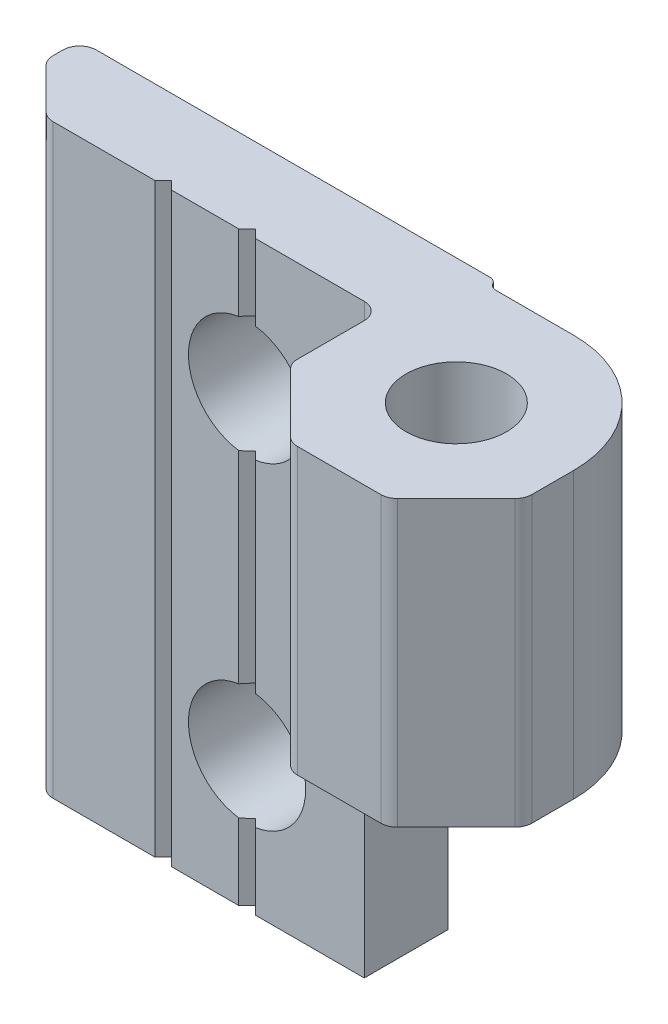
from build123d import *

# Parameters (mm, degrees)
SKETCH_1_R                = 3
EXTRUDE_1_DEPTH           = 35
SKETCH_2_W                = 25.824194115
SKETCH_2_H                = 25.192330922
CUT_EXTRUDE_1_DEPTH       = 35
HOLE_WIZARD_7_0_7_1_D     = 7
HOLE_WIZARD_7_0_7_1_DEPTH = 30
HOLE_WIZARD_7_0_7_1_TIP   = 2.103012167


with BuildPart() as part:
    # Sketch 1 → Extrude 1 (new body)
    with BuildSketch(Plane(origin=(0, 0, 0), x_dir=(1, 0, 0), z_dir=(0, 1, 0))):
        with BuildLine():
            Line((-30, 5.914213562), (-30, 6.5))
            ThreePointArc((-30, 6.5), (-29.707106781, 7.207106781), (-29, 7.5))
            Line((-29, 7.5), (-5.5, 7.5))
            ThreePointArc((-5.5, 7.5), (-5.25, 7.433012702), (-5.066987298, 7.25))
            ThreePointArc((-5.066987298, 7.25), (-4.883974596, 7.066987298), (-4.633974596, 7))
            Line((-4.633974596, 7), (0, 7))
            ThreePointArc((0, 7), (4.949747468, 4.949747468), (7, 0))
            Line((7, 0), (7, -2.485281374))
            ThreePointArc((7, -2.485281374), (6.923879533, -2.867964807), (6.707106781, -3.192388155))
            Line((6.707106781, -3.192388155), (3.192388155, -6.707106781))
            ThreePointArc((3.192388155, -6.707106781), (2.867964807, -6.923879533), (2.485281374, -7))
            Line((2.485281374, -7), (-2.485281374, -7))
            ThreePointArc((-2.485281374, -7), (-2.867964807, -6.923879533), (-3.192388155, -6.707106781))
            Line((-3.192388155, -6.707106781), (-6.707106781, -3.192388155))
            ThreePointArc((-6.707106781, -3.192388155), (-6.923879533, -2.867964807), (-7, -2.485281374))
            Line((-7, -2.485281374), (-7, 1.5))
            ThreePointArc((-7, 1.5), (-7.292893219, 2.207106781), (-8, 2.5))
            Line((-8, 2.5), (-14.5, 2.5))
            Line((-14.5, 2.5), (-15, 3))
            Line((-15, 3), (-15.5, 2.5))
            Line((-15.5, 2.5), (-19.5, 2.5))
            Line((-19.5, 2.5), (-20, 3))
            Line((-20, 3), (-20.5, 2.5))
            Line((-20.5, 2.5), (-26.585786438, 2.5))
            ThreePointArc((-26.585786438, 2.5), (-26.96846987, 2.576120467), (-27.292893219, 2.792893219))
            Line((-27.292893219, 2.792893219), (-29.707106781, 5.207106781))
            ThreePointArc((-29.707106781, 5.207106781), (-29.923879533, 5.53153013), (-30, 5.914213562))
        make_face()
        with Locations(Location((0, 0, 0), (0, 0, 270))):
            Circle(SKETCH_1_R, mode=Mode.SUBTRACT)
    extrude(amount=EXTRUDE_1_DEPTH)

    # Sketch 2 → Cut-Extrude 1 (cut)
    with BuildSketch(Plane(origin=(0, 0, -7.5), x_dir=(-1, 0, 0), z_dir=(0, 0, -1))):
        with Locations((-4.912097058, 5.403834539)):
            Rectangle(SKETCH_2_W, SKETCH_2_H)
    extrude(amount=-CUT_EXTRUDE_1_DEPTH, mode=Mode.SUBTRACT)

    # Hole Wizard 7.0 _7_ _1
    with Locations(Plane(origin=(-15, 27, -2.5), x_dir=(1, 0, 0), z_dir=(0, 0, 1))):
        with Locations((0, 0), (0, -19)):
            Hole(HOLE_WIZARD_7_0_7_1_D / 2, depth=HOLE_WIZARD_7_0_7_1_DEPTH)
            with Locations((0, 0, -(HOLE_WIZARD_7_0_7_1_DEPTH + HOLE_WIZARD_7_0_7_1_TIP / 2))):  # 118° drill point
                Cone(0, HOLE_WIZARD_7_0_7_1_D / 2, HOLE_WIZARD_7_0_7_1_TIP, mode=Mode.SUBTRACT)


solid = part.part
